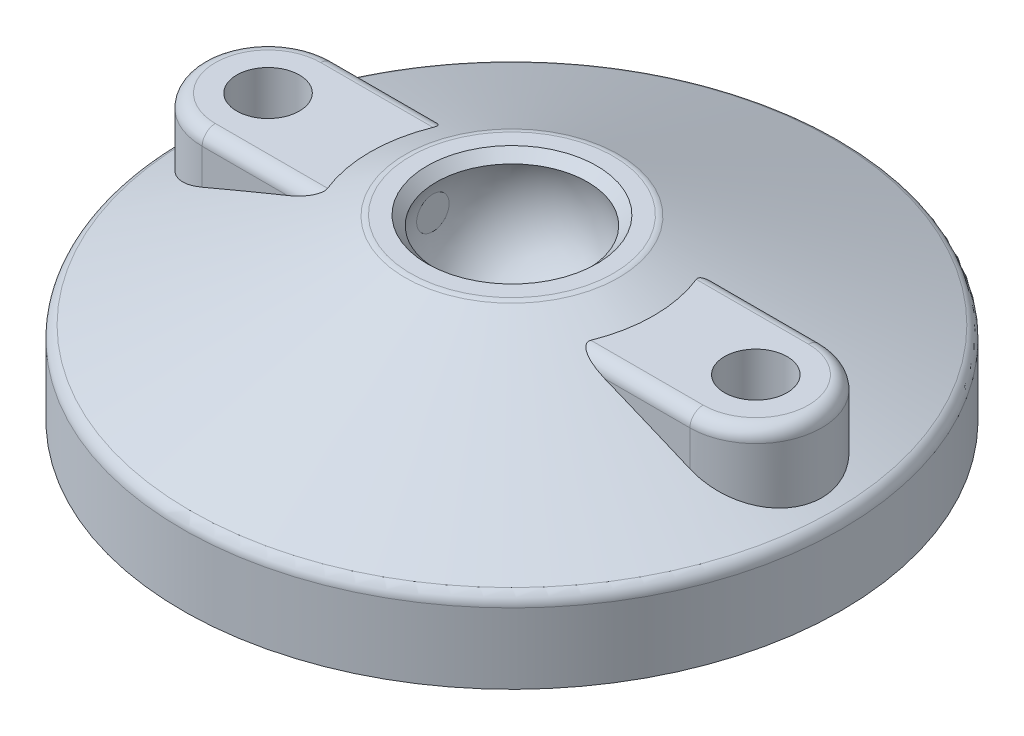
ISO-10303-21;
HEADER;
FILE_DESCRIPTION(('STEP AP214'),'2;1');
FILE_NAME('part.step','',(''),(''),'','','');
FILE_SCHEMA(('AUTOMOTIVE_DESIGN { 1 0 10303 214 1 1 1 1 }'));
ENDSEC;
DATA;
#1=APPLICATION_CONTEXT('core data for automotive mechanical design processes');
#2=APPLICATION_PROTOCOL_DEFINITION('international standard','automotive_design',2000,#1);
#3=PRODUCT_CONTEXT('',#1,'mechanical');
#4=PRODUCT('Part','Part','',(#3));
#5=PRODUCT_RELATED_PRODUCT_CATEGORY('part','',(#4));
#6=PRODUCT_DEFINITION_FORMATION('','',#4);
#7=PRODUCT_DEFINITION_CONTEXT('part definition',#1,'design');
#8=PRODUCT_DEFINITION('design','',#6,#7);
#9=PRODUCT_DEFINITION_SHAPE('','',#8);
#10=(LENGTH_UNIT() NAMED_UNIT(*) SI_UNIT(.MILLI.,.METRE.));
#11=(NAMED_UNIT(*) PLANE_ANGLE_UNIT() SI_UNIT($,.RADIAN.));
#12=(NAMED_UNIT(*) SI_UNIT($,.STERADIAN.) SOLID_ANGLE_UNIT());
#13=UNCERTAINTY_MEASURE_WITH_UNIT(LENGTH_MEASURE(1.E-05),#10,'distance_accuracy_value','');
#14=(GEOMETRIC_REPRESENTATION_CONTEXT(3) GLOBAL_UNCERTAINTY_ASSIGNED_CONTEXT((#13)) GLOBAL_UNIT_ASSIGNED_CONTEXT((#10,
#11,#12)) REPRESENTATION_CONTEXT('',''));
#15=CARTESIAN_POINT('',(0.,0.,0.));
#16=DIRECTION('',(0.,0.,1.));
#17=DIRECTION('',(1.,0.,0.));
#18=AXIS2_PLACEMENT_3D('',#15,#16,#17);
#19=CARTESIAN_POINT('',(-12.,4.99999999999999,-10.));
#20=DIRECTION('',(1.,0.,0.));
#21=DIRECTION('',(0.,0.,-1.));
#22=AXIS2_PLACEMENT_3D('',#19,#20,#21);
#23=PLANE('',#22);
#24=CARTESIAN_POINT('',(-12.,21.25,0.));
#25=DIRECTION('',(1.,0.,0.));
#26=DIRECTION('',(0.,0.,-1.));
#27=AXIS2_PLACEMENT_3D('',#24,#25,#26);
#28=CIRCLE('',#27,2.46221445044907);
#29=CARTESIAN_POINT('',(-12.,21.25,-2.46221445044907));
#30=VERTEX_POINT('',#29);
#31=EDGE_CURVE('E19',#30,#30,#28,.F.);
#32=ORIENTED_EDGE('',*,*,#31,.F.);
#33=EDGE_LOOP('',(#32));
#34=FACE_BOUND('',#33,.T.);
#35=ADVANCED_FACE('F15',(#34),#23,.T.);
#36=CARTESIAN_POINT('',(12.,5.,10.));
#37=DIRECTION('',(-1.,0.,0.));
#38=DIRECTION('',(0.,0.,1.));
#39=AXIS2_PLACEMENT_3D('',#36,#37,#38);
#40=PLANE('',#39);
#41=CARTESIAN_POINT('',(12.,21.25,0.));
#42=DIRECTION('',(-1.,0.,0.));
#43=DIRECTION('',(0.,0.,1.));
#44=AXIS2_PLACEMENT_3D('',#41,#42,#43);
#45=CIRCLE('',#44,2.46221445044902);
#46=CARTESIAN_POINT('',(12.,21.25,2.46221445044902));
#47=VERTEX_POINT('',#46);
#48=EDGE_CURVE('E220',#47,#47,#45,.F.);
#49=ORIENTED_EDGE('',*,*,#48,.F.);
#50=EDGE_LOOP('',(#49));
#51=FACE_BOUND('',#50,.T.);
#52=ADVANCED_FACE('F229',(#51),#40,.T.);
#53=CARTESIAN_POINT('',(0.,21.25,0.));
#54=DIRECTION('',(0.,0.,1.));
#55=DIRECTION('',(-1.,0.,0.));
#56=AXIS2_PLACEMENT_3D('',#53,#54,#55);
#57=SPHERICAL_SURFACE('',#56,12.25);
#58=CARTESIAN_POINT('',(0.,25.5857864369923,0.));
#59=DIRECTION('',(0.,1.,0.));
#60=DIRECTION('',(0.,0.,1.));
#61=AXIS2_PLACEMENT_3D('',#58,#59,#60);
#62=CIRCLE('',#61,11.4570264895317);
#63=CARTESIAN_POINT('',(0.,25.5857864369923,11.4570264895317));
#64=VERTEX_POINT('',#63);
#65=EDGE_CURVE('E218',#64,#64,#62,.T.);
#66=ORIENTED_EDGE('',*,*,#65,.T.);
#67=EDGE_LOOP('',(#66));
#68=FACE_BOUND('',#67,.T.);
#69=ORIENTED_EDGE('',*,*,#48,.T.);
#70=EDGE_LOOP('',(#69));
#71=FACE_BOUND('',#70,.T.);
#72=ORIENTED_EDGE('',*,*,#31,.T.);
#73=EDGE_LOOP('',(#72));
#74=FACE_BOUND('',#73,.T.);
#75=ADVANCED_FACE('F17',(#68,#71,#74),#57,.F.);
#76=CARTESIAN_POINT('',(0.,27.0000000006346,0.));
#77=DIRECTION('',(0.,1.,0.));
#78=DIRECTION('',(0.,0.,1.));
#79=AXIS2_PLACEMENT_3D('',#76,#77,#78);
#80=CONICAL_SURFACE('',#79,12.8712400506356,0.785398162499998);
#81=ORIENTED_EDGE('',*,*,#65,.F.);
#82=EDGE_LOOP('',(#81));
#83=FACE_BOUND('',#82,.T.);
#84=CARTESIAN_POINT('',(0.,27.0000000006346,0.));
#85=DIRECTION('',(0.,1.,0.));
#86=DIRECTION('',(0.,0.,1.));
#87=AXIS2_PLACEMENT_3D('',#84,#85,#86);
#88=CIRCLE('',#87,12.8712400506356);
#89=CARTESIAN_POINT('',(0.,27.0000000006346,12.8712400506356));
#90=VERTEX_POINT('',#89);
#91=EDGE_CURVE('E215',#90,#90,#88,.F.);
#92=ORIENTED_EDGE('',*,*,#91,.F.);
#93=EDGE_LOOP('',(#92));
#94=FACE_BOUND('',#93,.T.);
#95=ADVANCED_FACE('F460',(#83,#94),#80,.F.);
#96=CARTESIAN_POINT('',(14.1341947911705,27.,0.));
#97=DIRECTION('',(0.,1.,0.));
#98=DIRECTION('',(0.,0.,1.));
#99=AXIS2_PLACEMENT_3D('',#96,#97,#98);
#100=PLANE('',#99);
#101=ORIENTED_EDGE('',*,*,#91,.T.);
#102=EDGE_LOOP('',(#101));
#103=FACE_BOUND('',#102,.T.);
#104=CARTESIAN_POINT('',(0.,27.,0.));
#105=DIRECTION('',(0.,-1.,0.));
#106=DIRECTION('',(1.,0.,0.));
#107=AXIS2_PLACEMENT_3D('',#104,#105,#106);
#108=CIRCLE('',#107,15.3971495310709);
#109=CARTESIAN_POINT('',(15.3971495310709,27.,0.));
#110=VERTEX_POINT('',#109);
#111=EDGE_CURVE('E395',#110,#110,#108,.T.);
#112=ORIENTED_EDGE('',*,*,#111,.F.);
#113=EDGE_LOOP('',(#112));
#114=FACE_BOUND('',#113,.T.);
#115=ADVANCED_FACE('F455',(#103,#114),#100,.T.);
#116=CARTESIAN_POINT('',(0.,10.6935375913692,0.));
#117=DIRECTION('',(0.,-1.,0.));
#118=DIRECTION('',(0.,0.,-1.));
#119=AXIS2_PLACEMENT_3D('',#116,#117,#118);
#120=TOROIDAL_SURFACE('',#119,48.,2.);
#121=CARTESIAN_POINT('',(0.,12.5249700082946,0.));
#122=DIRECTION('',(0.,-1.,0.));
#123=DIRECTION('',(1.,0.,0.));
#124=AXIS2_PLACEMENT_3D('',#121,#122,#123);
#125=CIRCLE('',#124,48.8036511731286);
#126=CARTESIAN_POINT('',(48.8036511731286,12.5249700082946,0.));
#127=VERTEX_POINT('',#126);
#128=EDGE_CURVE('E214',#127,#127,#125,.F.);
#129=ORIENTED_EDGE('',*,*,#128,.F.);
#130=EDGE_LOOP('',(#129));
#131=FACE_BOUND('',#130,.T.);
#132=CARTESIAN_POINT('',(0.,10.6935375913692,0.));
#133=DIRECTION('',(0.,-1.,0.));
#134=DIRECTION('',(1.,0.,0.));
#135=AXIS2_PLACEMENT_3D('',#132,#133,#134);
#136=CIRCLE('',#135,50.);
#137=CARTESIAN_POINT('',(50.,10.6935375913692,0.));
#138=VERTEX_POINT('',#137);
#139=EDGE_CURVE('E392',#138,#138,#136,.T.);
#140=ORIENTED_EDGE('',*,*,#139,.F.);
#141=EDGE_LOOP('',(#140));
#142=FACE_BOUND('',#141,.T.);
#143=ADVANCED_FACE('F205',(#131,#142),#120,.T.);
#144=CARTESIAN_POINT('',(-12.,4.99999999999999,10.));
#145=DIRECTION('',(0.,0.,1.));
#146=DIRECTION('',(1.,0.,0.));
#147=AXIS2_PLACEMENT_3D('',#144,#145,#146);
#148=PLANE('',#147);
#149=DIRECTION('',(0.,1.,0.));
#150=VECTOR('',#149,1.);
#151=CARTESIAN_POINT('',(-37.,4.99999999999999,10.));
#152=LINE('',#151,#150);
#153=CARTESIAN_POINT('',(-36.9999998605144,17.1219960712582,10.));
#154=VERTEX_POINT('',#153);
#155=CARTESIAN_POINT('',(-37.,22.5,10.));
#156=VERTEX_POINT('',#155);
#157=EDGE_CURVE('E68',#154,#156,#152,.T.);
#158=ORIENTED_EDGE('',*,*,#157,.F.);
#159=CARTESIAN_POINT('',(-24.0776106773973,22.4999999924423,9.99999999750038));
#160=CARTESIAN_POINT('',(-24.6181248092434,22.2809472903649,9.99999999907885));
#161=CARTESIAN_POINT('',(-25.1582677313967,22.060981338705,9.99999999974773));
#162=CARTESIAN_POINT('',(-26.2379094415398,21.6194777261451,10.0000000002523));
#163=CARTESIAN_POINT('',(-26.7774082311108,21.3979400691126,10.0000000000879));
#164=CARTESIAN_POINT('',(-28.3950742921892,20.7313564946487,9.99999999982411));
#165=CARTESIAN_POINT('',(-29.472426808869,20.2843336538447,9.99999999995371));
#166=CARTESIAN_POINT('',(-31.6255067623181,19.386419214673,10.0000000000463));
#167=CARTESIAN_POINT('',(-32.7012342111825,18.9355276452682,10.0000000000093));
#168=CARTESIAN_POINT('',(-34.3139051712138,18.2569828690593,9.99999999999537));
#169=CARTESIAN_POINT('',(-34.8513127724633,18.0304316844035,9.99999999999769));
#170=CARTESIAN_POINT('',(-35.9258533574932,17.5766798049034,10.0000000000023));
#171=CARTESIAN_POINT('',(-36.4629863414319,17.3494791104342,10.0000000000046));
#172=CARTESIAN_POINT('',(-36.9999997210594,17.1219961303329,10.));
#173=B_SPLINE_CURVE_WITH_KNOTS('',3,(#159,#160,#161,#162,#163,#164,#165,#166,#167,#168,#169,
#170,#171,#172),.UNSPECIFIED.,.F.,.F.,(4,2,2,2,2,2,4),(0.,1.74964231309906,3.4992803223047,
6.99850597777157,10.4977054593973,12.2473311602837,13.9969558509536),.UNSPECIFIED.);
#174=CARTESIAN_POINT('',(-24.077610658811,22.4999999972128,10.));
#175=VERTEX_POINT('',#174);
#176=EDGE_CURVE('E209',#175,#154,#173,.T.);
#177=ORIENTED_EDGE('',*,*,#176,.F.);
#178=DIRECTION('',(-1.,0.,0.));
#179=VECTOR('',#178,1.);
#180=CARTESIAN_POINT('',(-19.8425477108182,22.5,10.));
#181=LINE('',#180,#179);
#182=EDGE_CURVE('E58',#156,#175,#181,.F.);
#183=ORIENTED_EDGE('',*,*,#182,.F.);
#184=EDGE_LOOP('',(#158,#177,#183));
#185=FACE_BOUND('',#184,.T.);
#186=ADVANCED_FACE('F201',(#185),#148,.T.);
#187=CARTESIAN_POINT('',(-37.,4.99999999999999,0.));
#188=DIRECTION('',(0.,1.,0.));
#189=DIRECTION('',(-1.,0.,0.));
#190=AXIS2_PLACEMENT_3D('',#187,#188,#189);
#191=CYLINDRICAL_SURFACE('',#190,10.);
#192=CARTESIAN_POINT('',(-36.9999997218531,17.1219961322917,10.0000000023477));
#193=CARTESIAN_POINT('',(-37.2929987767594,16.9978689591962,10.0000220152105));
#194=CARTESIAN_POINT('',(-37.5865196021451,16.8749136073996,9.98712293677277));
#195=CARTESIAN_POINT('',(-38.1725784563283,16.6319807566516,9.93536621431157));
#196=CARTESIAN_POINT('',(-38.4651162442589,16.5120039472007,9.89650261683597));
#197=CARTESIAN_POINT('',(-39.0476557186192,16.2754725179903,9.7925916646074));
#198=CARTESIAN_POINT('',(-39.3376508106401,16.1589255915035,9.72748964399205));
#199=CARTESIAN_POINT('',(-39.9122499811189,15.9301738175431,9.57117719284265));
#200=CARTESIAN_POINT('',(-40.1968544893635,15.8179686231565,9.47996885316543));
#201=CARTESIAN_POINT('',(-40.7589783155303,15.5983106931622,9.27146816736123));
#202=CARTESIAN_POINT('',(-41.0364824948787,15.4908678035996,9.15412455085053));
#203=CARTESIAN_POINT('',(-41.5814600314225,15.2816060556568,8.89389657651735));
#204=CARTESIAN_POINT('',(-41.8489336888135,15.179787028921,8.75101298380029));
#205=CARTESIAN_POINT('',(-42.3711949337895,14.9824926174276,8.44052479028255));
#206=CARTESIAN_POINT('',(-42.6259952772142,14.8870108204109,8.27294574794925));
#207=CARTESIAN_POINT('',(-43.1207874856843,14.7028870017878,7.91387280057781));
#208=CARTESIAN_POINT('',(-43.3607802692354,14.6142445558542,7.7223803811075));
#209=CARTESIAN_POINT('',(-43.811954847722,14.4486493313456,7.32684840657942));
#210=CARTESIAN_POINT('',(-44.023978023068,14.3713331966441,7.12392034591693));
#211=CARTESIAN_POINT('',(-44.4304988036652,14.2238874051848,6.69881815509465));
#212=CARTESIAN_POINT('',(-44.624997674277,14.153757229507,6.47664541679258));
#213=CARTESIAN_POINT('',(-44.9945532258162,14.0211376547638,6.01453666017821));
#214=CARTESIAN_POINT('',(-45.1696094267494,13.9586484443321,5.77460020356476));
#215=CARTESIAN_POINT('',(-45.4984500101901,13.8417425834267,5.27871579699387));
#216=CARTESIAN_POINT('',(-45.6522355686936,13.7873254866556,5.02276873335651));
#217=CARTESIAN_POINT('',(-45.927765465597,13.69016267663,4.51368385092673));
#218=CARTESIAN_POINT('',(-46.0509301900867,13.6468930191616,4.26141376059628));
#219=CARTESIAN_POINT('',(-46.2759600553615,13.5680445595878,3.74640079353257));
#220=CARTESIAN_POINT('',(-46.3778269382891,13.5324651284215,3.48365877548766));
#221=CARTESIAN_POINT('',(-46.55921212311,13.4692409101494,2.94973469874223));
#222=CARTESIAN_POINT('',(-46.638737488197,13.4415936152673,2.67855533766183));
#223=CARTESIAN_POINT('',(-46.774660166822,13.394407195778,2.12976988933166));
#224=CARTESIAN_POINT('',(-46.8310581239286,13.3748678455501,1.85216398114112));
#225=CARTESIAN_POINT('',(-46.9180804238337,13.3447435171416,1.30563532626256));
#226=CARTESIAN_POINT('',(-46.9497735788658,13.333787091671,1.03690267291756));
#227=CARTESIAN_POINT('',(-46.9912753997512,13.3194433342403,0.497556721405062));
#228=CARTESIAN_POINT('',(-47.0010848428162,13.3160557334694,0.226943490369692));
#229=CARTESIAN_POINT('',(-46.9987250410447,13.3168709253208,-0.314147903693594));
#230=CARTESIAN_POINT('',(-46.9865579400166,13.3210729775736,-0.584626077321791));
#231=CARTESIAN_POINT('',(-46.9403675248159,13.337039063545,-1.12348443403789));
#232=CARTESIAN_POINT('',(-46.9063442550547,13.3488030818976,-1.39186462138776));
#233=CARTESIAN_POINT('',(-46.8175275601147,13.3795559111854,-1.92006853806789));
#234=CARTESIAN_POINT('',(-46.7630942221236,13.398419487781,-2.17996023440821));
#235=CARTESIAN_POINT('',(-46.6339255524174,13.4432673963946,-2.69401390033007));
#236=CARTESIAN_POINT('',(-46.5591905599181,13.4692516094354,-2.94817596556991));
#237=CARTESIAN_POINT('',(-46.3900967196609,13.5281853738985,-3.4490509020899));
#238=CARTESIAN_POINT('',(-46.2957378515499,13.5611349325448,-3.69576376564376));
#239=CARTESIAN_POINT('',(-46.088233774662,13.6338067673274,-4.18012267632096));
#240=CARTESIAN_POINT('',(-45.9750882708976,13.6735291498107,-4.41776858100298));
#241=CARTESIAN_POINT('',(-45.7292123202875,13.7601464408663,-4.88587345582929));
#242=CARTESIAN_POINT('',(-45.5962208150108,13.8071373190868,-5.11617750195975));
#243=CARTESIAN_POINT('',(-45.3130567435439,13.9075900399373,-5.5644747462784));
#244=CARTESIAN_POINT('',(-45.1628840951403,13.9610519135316,-5.78246788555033));
#245=CARTESIAN_POINT('',(-44.8466032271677,14.0741552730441,-6.20487192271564));
#246=CARTESIAN_POINT('',(-44.6804944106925,14.1337969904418,-6.40928231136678));
#247=CARTESIAN_POINT('',(-44.3336704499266,14.2589456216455,-6.80339544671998));
#248=CARTESIAN_POINT('',(-44.15295439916,14.3244528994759,-6.99309727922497));
#249=CARTESIAN_POINT('',(-43.7706027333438,14.4638073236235,-7.36429356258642));
#250=CARTESIAN_POINT('',(-43.568412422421,14.5378866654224,-7.54512957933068));
#251=CARTESIAN_POINT('',(-43.1513240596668,14.6916479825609,-7.88886873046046));
#252=CARTESIAN_POINT('',(-42.9364256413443,14.771330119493,-8.05177134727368));
#253=CARTESIAN_POINT('',(-42.4955112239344,14.9359090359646,-8.35892088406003));
#254=CARTESIAN_POINT('',(-42.2694928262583,15.0208069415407,-8.50316375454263));
#255=CARTESIAN_POINT('',(-41.8079279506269,15.1954220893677,-8.77241410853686));
#256=CARTESIAN_POINT('',(-41.5723774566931,15.2851413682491,-8.89741337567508));
#257=CARTESIAN_POINT('',(-41.0793108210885,15.4743765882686,-9.13446216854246));
#258=CARTESIAN_POINT('',(-40.8213189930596,15.5741581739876,-9.24531094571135));
#259=CARTESIAN_POINT('',(-40.2985726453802,15.7780694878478,-9.44444943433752));
#260=CARTESIAN_POINT('',(-40.0338205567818,15.8821976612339,-9.53274713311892));
#261=CARTESIAN_POINT('',(-39.4994762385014,16.0942569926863,-9.68658237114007));
#262=CARTESIAN_POINT('',(-39.2298868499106,16.2021859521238,-9.75213283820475));
#263=CARTESIAN_POINT('',(-38.6876063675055,16.4213445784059,-9.86044595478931));
#264=CARTESIAN_POINT('',(-38.4149165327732,16.5325729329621,-9.90321753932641));
#265=CARTESIAN_POINT('',(-37.9514129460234,16.7235052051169,-9.9564777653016));
#266=CARTESIAN_POINT('',(-37.7609560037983,16.8024933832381,-9.97283108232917));
#267=CARTESIAN_POINT('',(-37.3802671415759,16.961488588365,-9.99458261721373));
#268=CARTESIAN_POINT('',(-37.1900354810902,17.0414933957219,-10.0000015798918));
#269=CARTESIAN_POINT('',(-36.9999999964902,17.1219960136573,-10.));
#270=B_SPLINE_CURVE_WITH_KNOTS('',3,(#192,#193,#194,#195,#196,#197,#198,#199,#200,#201,#202,
#203,#204,#205,#206,#207,#208,#209,#210,#211,#212,#213,#214,#215,#216,#217,#218,#219,#220,#221,
#222,#223,#224,#225,#226,#227,#228,#229,#230,#231,#232,#233,#234,#235,#236,#237,#238,#239,#240,
#241,#242,#243,#244,#245,#246,#247,#248,#249,#250,#251,#252,#253,#254,#255,#256,#257,#258,#259,
#260,#261,#262,#263,#264,#265,#266,#267,#268,#269),.UNSPECIFIED.,.F.,.F.,(4,2,2,2,2,2,2,2,2,2,2,
2,2,2,2,2,2,2,2,2,2,2,2,2,2,2,2,2,2,2,2,2,2,2,2,2,2,2,4),(0.,0.954393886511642,1.90900668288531,
2.86561871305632,3.82215414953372,4.78058284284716,5.73898282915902,6.69639779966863,
7.65375332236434,8.56307793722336,9.47233684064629,10.3816181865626,11.2908492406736,
12.1419149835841,12.9929110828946,13.8436378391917,14.6943409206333,15.5058056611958,
16.3172415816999,17.1285983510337,17.9399534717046,18.7376205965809,19.5352743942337,
20.3329290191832,21.130596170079,21.9398718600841,22.7491514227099,23.5584613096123,
24.3678214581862,25.2104689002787,26.0531406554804,26.8959949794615,27.7392081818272,
28.6322193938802,29.524913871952,30.4171001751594,31.3089362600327,31.9291636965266,
32.5482133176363),.UNSPECIFIED.);
#271=CARTESIAN_POINT('',(-36.9999999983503,17.1219960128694,-10.));
#272=VERTEX_POINT('',#271);
#273=EDGE_CURVE('E154',#154,#272,#270,.T.);
#274=ORIENTED_EDGE('',*,*,#273,.F.);
#275=ORIENTED_EDGE('',*,*,#157,.T.);
#276=CARTESIAN_POINT('',(-37.,22.5,0.));
#277=DIRECTION('',(0.,-1.,0.));
#278=DIRECTION('',(0.,0.,-1.));
#279=AXIS2_PLACEMENT_3D('',#276,#277,#278);
#280=CIRCLE('',#279,10.);
#281=CARTESIAN_POINT('',(-37.,22.5,-10.));
#282=VERTEX_POINT('',#281);
#283=EDGE_CURVE('E328',#282,#156,#280,.F.);
#284=ORIENTED_EDGE('',*,*,#283,.F.);
#285=DIRECTION('',(0.,1.,0.));
#286=VECTOR('',#285,1.);
#287=CARTESIAN_POINT('',(-37.,4.99999999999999,-10.));
#288=LINE('',#287,#286);
#289=EDGE_CURVE('E116',#272,#282,#288,.T.);
#290=ORIENTED_EDGE('',*,*,#289,.F.);
#291=EDGE_LOOP('',(#274,#275,#284,#290));
#292=FACE_BOUND('',#291,.T.);
#293=ADVANCED_FACE('F195',(#292),#191,.T.);
#294=CARTESIAN_POINT('',(-37.,4.99999999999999,-10.));
#295=DIRECTION('',(0.,0.,-1.));
#296=DIRECTION('',(-1.,0.,0.));
#297=AXIS2_PLACEMENT_3D('',#294,#295,#296);
#298=PLANE('',#297);
#299=CARTESIAN_POINT('',(-36.9999999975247,17.1219960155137,-10.0000000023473));
#300=CARTESIAN_POINT('',(-36.4629866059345,17.3494789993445,-10.000000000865));
#301=CARTESIAN_POINT('',(-35.9258536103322,17.5766796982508,-10.0000000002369));
#302=CARTESIAN_POINT('',(-34.8513130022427,18.0304315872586,-9.9999999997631));
#303=CARTESIAN_POINT('',(-34.3139053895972,18.256982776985,-9.99999999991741));
#304=CARTESIAN_POINT('',(-32.7012343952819,18.9355275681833,-10.0000000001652));
#305=CARTESIAN_POINT('',(-31.6255069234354,19.3864191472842,-10.0000000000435));
#306=CARTESIAN_POINT('',(-29.4724269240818,20.2843336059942,-9.99999999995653));
#307=CARTESIAN_POINT('',(-28.3950743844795,20.7313564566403,-9.99999999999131));
#308=CARTESIAN_POINT('',(-26.7774082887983,21.3979400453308,-10.0000000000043));
#309=CARTESIAN_POINT('',(-26.2379094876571,21.6194777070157,-10.0000000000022));
#310=CARTESIAN_POINT('',(-25.1582677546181,22.060981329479,-9.99999999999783));
#311=CARTESIAN_POINT('',(-24.6181248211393,22.2809472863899,-9.99999999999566));
#312=CARTESIAN_POINT('',(-24.077610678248,22.4999999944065,-10.));
#313=B_SPLINE_CURVE_WITH_KNOTS('',3,(#299,#300,#301,#302,#303,#304,#305,#306,#307,#308,#309,
#310,#311,#312),.UNSPECIFIED.,.F.,.F.,(4,2,2,2,2,2,4),(0.,1.74962472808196,3.4992504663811,
6.99845002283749,10.497675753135,12.2473137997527,13.9969561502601),.UNSPECIFIED.);
#314=CARTESIAN_POINT('',(-24.0776106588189,22.4999999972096,-10.));
#315=VERTEX_POINT('',#314);
#316=EDGE_CURVE('E187',#272,#315,#313,.T.);
#317=ORIENTED_EDGE('',*,*,#316,.F.);
#318=ORIENTED_EDGE('',*,*,#289,.T.);
#319=DIRECTION('',(1.,0.,0.));
#320=VECTOR('',#319,1.);
#321=CARTESIAN_POINT('',(-32.3425477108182,22.5,-10.));
#322=LINE('',#321,#320);
#323=EDGE_CURVE('E352',#315,#282,#322,.F.);
#324=ORIENTED_EDGE('',*,*,#323,.F.);
#325=EDGE_LOOP('',(#317,#318,#324));
#326=FACE_BOUND('',#325,.T.);
#327=ADVANCED_FACE('F192',(#326),#298,.T.);
#328=CARTESIAN_POINT('',(12.,5.,-10.));
#329=DIRECTION('',(0.,0.,-1.));
#330=DIRECTION('',(-1.,0.,0.));
#331=AXIS2_PLACEMENT_3D('',#328,#329,#330);
#332=PLANE('',#331);
#333=DIRECTION('',(0.,1.,0.));
#334=VECTOR('',#333,1.);
#335=CARTESIAN_POINT('',(37.,5.,-10.));
#336=LINE('',#335,#334);
#337=CARTESIAN_POINT('',(36.9999998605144,17.1219960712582,-10.));
#338=VERTEX_POINT('',#337);
#339=CARTESIAN_POINT('',(37.,22.5,-10.));
#340=VERTEX_POINT('',#339);
#341=EDGE_CURVE('E110',#338,#340,#336,.T.);
#342=ORIENTED_EDGE('',*,*,#341,.F.);
#343=CARTESIAN_POINT('',(24.0776106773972,22.4999999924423,-9.99999999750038));
#344=CARTESIAN_POINT('',(24.6181248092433,22.280947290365,-9.99999999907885));
#345=CARTESIAN_POINT('',(25.1582677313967,22.060981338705,-9.99999999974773));
#346=CARTESIAN_POINT('',(26.2379094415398,21.6194777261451,-10.0000000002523));
#347=CARTESIAN_POINT('',(26.7774082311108,21.3979400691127,-10.0000000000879));
#348=CARTESIAN_POINT('',(28.3950742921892,20.7313564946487,-9.99999999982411));
#349=CARTESIAN_POINT('',(29.472426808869,20.2843336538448,-9.99999999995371));
#350=CARTESIAN_POINT('',(31.6255067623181,19.386419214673,-10.0000000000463));
#351=CARTESIAN_POINT('',(32.7012342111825,18.9355276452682,-10.0000000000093));
#352=CARTESIAN_POINT('',(34.3139051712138,18.2569828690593,-9.99999999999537));
#353=CARTESIAN_POINT('',(34.8513127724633,18.0304316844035,-9.99999999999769));
#354=CARTESIAN_POINT('',(35.9258533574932,17.5766798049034,-10.0000000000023));
#355=CARTESIAN_POINT('',(36.4629863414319,17.3494791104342,-10.0000000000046));
#356=CARTESIAN_POINT('',(36.9999997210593,17.121996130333,-10.));
#357=B_SPLINE_CURVE_WITH_KNOTS('',3,(#343,#344,#345,#346,#347,#348,#349,#350,#351,#352,#353,
#354,#355,#356),.UNSPECIFIED.,.F.,.F.,(4,2,2,2,2,2,4),(0.,1.74964231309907,3.49928032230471,
6.99850597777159,10.4977054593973,12.2473311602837,13.9969558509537),.UNSPECIFIED.);
#358=CARTESIAN_POINT('',(24.0776106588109,22.4999999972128,-10.));
#359=VERTEX_POINT('',#358);
#360=EDGE_CURVE('E97',#359,#338,#357,.T.);
#361=ORIENTED_EDGE('',*,*,#360,.F.);
#362=DIRECTION('',(1.,0.,0.));
#363=VECTOR('',#362,1.);
#364=CARTESIAN_POINT('',(19.8425477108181,22.5,-10.));
#365=LINE('',#364,#363);
#366=EDGE_CURVE('E92',#340,#359,#365,.F.);
#367=ORIENTED_EDGE('',*,*,#366,.F.);
#368=EDGE_LOOP('',(#342,#361,#367));
#369=FACE_BOUND('',#368,.T.);
#370=ADVANCED_FACE('F111',(#369),#332,.T.);
#371=CARTESIAN_POINT('',(37.,5.,0.));
#372=DIRECTION('',(0.,1.,0.));
#373=DIRECTION('',(-1.,0.,0.));
#374=AXIS2_PLACEMENT_3D('',#371,#372,#373);
#375=CYLINDRICAL_SURFACE('',#374,10.);
#376=CARTESIAN_POINT('',(36.9999997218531,17.1219961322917,-10.0000000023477));
#377=CARTESIAN_POINT('',(37.2929987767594,16.9978689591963,-10.0000220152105));
#378=CARTESIAN_POINT('',(37.5865196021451,16.8749136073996,-9.98712293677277));
#379=CARTESIAN_POINT('',(38.1725784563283,16.6319807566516,-9.93536621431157));
#380=CARTESIAN_POINT('',(38.4651162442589,16.5120039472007,-9.89650261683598));
#381=CARTESIAN_POINT('',(39.0476557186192,16.2754725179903,-9.79259166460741));
#382=CARTESIAN_POINT('',(39.3376508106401,16.1589255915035,-9.72748964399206));
#383=CARTESIAN_POINT('',(39.9122499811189,15.9301738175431,-9.57117719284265));
#384=CARTESIAN_POINT('',(40.1968544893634,15.8179686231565,-9.47996885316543));
#385=CARTESIAN_POINT('',(40.7589783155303,15.5983106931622,-9.27146816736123));
#386=CARTESIAN_POINT('',(41.0364824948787,15.4908678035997,-9.15412455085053));
#387=CARTESIAN_POINT('',(41.5814600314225,15.2816060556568,-8.89389657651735));
#388=CARTESIAN_POINT('',(41.8489336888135,15.179787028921,-8.75101298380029));
#389=CARTESIAN_POINT('',(42.3711949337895,14.9824926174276,-8.44052479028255));
#390=CARTESIAN_POINT('',(42.6259952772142,14.8870108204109,-8.27294574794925));
#391=CARTESIAN_POINT('',(43.1207874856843,14.7028870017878,-7.91387280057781));
#392=CARTESIAN_POINT('',(43.3607802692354,14.6142445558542,-7.7223803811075));
#393=CARTESIAN_POINT('',(43.811954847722,14.4486493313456,-7.32684840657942));
#394=CARTESIAN_POINT('',(44.023978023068,14.3713331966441,-7.12392034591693));
#395=CARTESIAN_POINT('',(44.4304988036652,14.2238874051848,-6.69881815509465));
#396=CARTESIAN_POINT('',(44.624997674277,14.153757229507,-6.47664541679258));
#397=CARTESIAN_POINT('',(44.9945532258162,14.0211376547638,-6.01453666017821));
#398=CARTESIAN_POINT('',(45.1696094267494,13.9586484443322,-5.77460020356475));
#399=CARTESIAN_POINT('',(45.4984500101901,13.8417425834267,-5.27871579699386));
#400=CARTESIAN_POINT('',(45.6522355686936,13.7873254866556,-5.0227687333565));
#401=CARTESIAN_POINT('',(45.927765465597,13.6901626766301,-4.51368385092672));
#402=CARTESIAN_POINT('',(46.0509301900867,13.6468930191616,-4.26141376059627));
#403=CARTESIAN_POINT('',(46.2759600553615,13.5680445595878,-3.74640079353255));
#404=CARTESIAN_POINT('',(46.3778269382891,13.5324651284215,-3.48365877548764));
#405=CARTESIAN_POINT('',(46.55921212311,13.4692409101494,-2.94973469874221));
#406=CARTESIAN_POINT('',(46.638737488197,13.4415936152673,-2.67855533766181));
#407=CARTESIAN_POINT('',(46.774660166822,13.394407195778,-2.12976988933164));
#408=CARTESIAN_POINT('',(46.8310581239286,13.3748678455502,-1.85216398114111));
#409=CARTESIAN_POINT('',(46.9180804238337,13.3447435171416,-1.30563532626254));
#410=CARTESIAN_POINT('',(46.9497735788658,13.333787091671,-1.03690267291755));
#411=CARTESIAN_POINT('',(46.9912753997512,13.3194433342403,-0.497556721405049));
#412=CARTESIAN_POINT('',(47.0010848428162,13.3160557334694,-0.22694349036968));
#413=CARTESIAN_POINT('',(46.9987250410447,13.3168709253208,0.314147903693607));
#414=CARTESIAN_POINT('',(46.9865579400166,13.3210729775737,0.584626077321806));
#415=CARTESIAN_POINT('',(46.9403675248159,13.337039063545,1.12348443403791));
#416=CARTESIAN_POINT('',(46.9063442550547,13.3488030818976,1.39186462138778));
#417=CARTESIAN_POINT('',(46.8175275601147,13.3795559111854,1.9200685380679));
#418=CARTESIAN_POINT('',(46.7630942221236,13.3984194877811,2.17996023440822));
#419=CARTESIAN_POINT('',(46.6339255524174,13.4432673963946,2.69401390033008));
#420=CARTESIAN_POINT('',(46.5591905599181,13.4692516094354,2.94817596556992));
#421=CARTESIAN_POINT('',(46.3900967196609,13.5281853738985,3.44905090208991));
#422=CARTESIAN_POINT('',(46.2957378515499,13.5611349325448,3.69576376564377));
#423=CARTESIAN_POINT('',(46.088233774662,13.6338067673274,4.18012267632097));
#424=CARTESIAN_POINT('',(45.9750882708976,13.6735291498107,4.41776858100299));
#425=CARTESIAN_POINT('',(45.7292123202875,13.7601464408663,4.8858734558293));
#426=CARTESIAN_POINT('',(45.5962208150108,13.8071373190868,5.11617750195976));
#427=CARTESIAN_POINT('',(45.3130567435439,13.9075900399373,5.56447474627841));
#428=CARTESIAN_POINT('',(45.1628840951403,13.9610519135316,5.78246788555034));
#429=CARTESIAN_POINT('',(44.8466032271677,14.0741552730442,6.20487192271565));
#430=CARTESIAN_POINT('',(44.6804944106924,14.1337969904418,6.4092823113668));
#431=CARTESIAN_POINT('',(44.3336704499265,14.2589456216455,6.80339544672));
#432=CARTESIAN_POINT('',(44.1529543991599,14.3244528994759,6.99309727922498));
#433=CARTESIAN_POINT('',(43.7706027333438,14.4638073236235,7.36429356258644));
#434=CARTESIAN_POINT('',(43.568412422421,14.5378866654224,7.54512957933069));
#435=CARTESIAN_POINT('',(43.1513240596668,14.6916479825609,7.88886873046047));
#436=CARTESIAN_POINT('',(42.9364256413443,14.771330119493,8.05177134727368));
#437=CARTESIAN_POINT('',(42.4955112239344,14.9359090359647,8.35892088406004));
#438=CARTESIAN_POINT('',(42.2694928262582,15.0208069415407,8.50316375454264));
#439=CARTESIAN_POINT('',(41.8079279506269,15.1954220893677,8.77241410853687));
#440=CARTESIAN_POINT('',(41.5723774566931,15.2851413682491,8.89741337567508));
#441=CARTESIAN_POINT('',(41.0793108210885,15.4743765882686,9.13446216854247));
#442=CARTESIAN_POINT('',(40.8213189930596,15.5741581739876,9.24531094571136));
#443=CARTESIAN_POINT('',(40.2985726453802,15.7780694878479,9.44444943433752));
#444=CARTESIAN_POINT('',(40.0338205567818,15.8821976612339,9.53274713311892));
#445=CARTESIAN_POINT('',(39.4994762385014,16.0942569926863,9.68658237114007));
#446=CARTESIAN_POINT('',(39.2298868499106,16.2021859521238,9.75213283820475));
#447=CARTESIAN_POINT('',(38.6876063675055,16.4213445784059,9.86044595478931));
#448=CARTESIAN_POINT('',(38.4149165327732,16.5325729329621,9.90321753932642));
#449=CARTESIAN_POINT('',(37.9514129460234,16.723505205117,9.9564777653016));
#450=CARTESIAN_POINT('',(37.7609560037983,16.8024933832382,9.97283108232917));
#451=CARTESIAN_POINT('',(37.3802671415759,16.961488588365,9.99458261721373));
#452=CARTESIAN_POINT('',(37.1900354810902,17.0414933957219,10.0000015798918));
#453=CARTESIAN_POINT('',(36.9999999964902,17.1219960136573,10.));
#454=B_SPLINE_CURVE_WITH_KNOTS('',3,(#376,#377,#378,#379,#380,#381,#382,#383,#384,#385,#386,
#387,#388,#389,#390,#391,#392,#393,#394,#395,#396,#397,#398,#399,#400,#401,#402,#403,#404,#405,
#406,#407,#408,#409,#410,#411,#412,#413,#414,#415,#416,#417,#418,#419,#420,#421,#422,#423,#424,
#425,#426,#427,#428,#429,#430,#431,#432,#433,#434,#435,#436,#437,#438,#439,#440,#441,#442,#443,
#444,#445,#446,#447,#448,#449,#450,#451,#452,#453),.UNSPECIFIED.,.F.,.F.,(4,2,2,2,2,2,2,2,2,2,2,
2,2,2,2,2,2,2,2,2,2,2,2,2,2,2,2,2,2,2,2,2,2,2,2,2,2,2,4),(0.,0.95439388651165,1.90900668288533,
2.86561871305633,3.82215414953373,4.78058284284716,5.73898282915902,6.69639779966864,
7.65375332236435,8.56307793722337,9.4723368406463,10.3816181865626,11.2908492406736,
12.1419149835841,12.9929110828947,13.8436378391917,14.6943409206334,15.5058056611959,
16.3172415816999,17.1285983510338,17.9399534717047,18.7376205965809,19.5352743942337,
20.3329290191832,21.130596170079,21.9398718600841,22.7491514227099,23.5584613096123,
24.3678214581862,25.2104689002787,26.0531406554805,26.8959949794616,27.7392081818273,
28.6322193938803,29.5249138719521,30.4171001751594,31.3089362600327,31.9291636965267,
32.5482133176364),.UNSPECIFIED.);
#455=CARTESIAN_POINT('',(36.9999999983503,17.1219960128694,10.));
#456=VERTEX_POINT('',#455);
#457=EDGE_CURVE('E103',#338,#456,#454,.T.);
#458=ORIENTED_EDGE('',*,*,#457,.F.);
#459=ORIENTED_EDGE('',*,*,#341,.T.);
#460=CARTESIAN_POINT('',(37.,22.5,0.));
#461=DIRECTION('',(0.,-1.,0.));
#462=DIRECTION('',(0.,0.,-1.));
#463=AXIS2_PLACEMENT_3D('',#460,#461,#462);
#464=CIRCLE('',#463,10.);
#465=CARTESIAN_POINT('',(37.,22.5,10.));
#466=VERTEX_POINT('',#465);
#467=EDGE_CURVE('E360',#466,#340,#464,.F.);
#468=ORIENTED_EDGE('',*,*,#467,.F.);
#469=DIRECTION('',(0.,1.,0.));
#470=VECTOR('',#469,1.);
#471=CARTESIAN_POINT('',(37.,5.,10.));
#472=LINE('',#471,#470);
#473=EDGE_CURVE('E115',#456,#466,#472,.T.);
#474=ORIENTED_EDGE('',*,*,#473,.F.);
#475=EDGE_LOOP('',(#458,#459,#468,#474));
#476=FACE_BOUND('',#475,.T.);
#477=ADVANCED_FACE('F118',(#476),#375,.T.);
#478=CARTESIAN_POINT('',(37.,5.,10.));
#479=DIRECTION('',(0.,0.,1.));
#480=DIRECTION('',(1.,0.,0.));
#481=AXIS2_PLACEMENT_3D('',#478,#479,#480);
#482=PLANE('',#481);
#483=CARTESIAN_POINT('',(36.9999999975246,17.1219960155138,10.0000000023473));
#484=CARTESIAN_POINT('',(36.4629866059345,17.3494789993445,10.000000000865));
#485=CARTESIAN_POINT('',(35.9258536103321,17.5766796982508,10.0000000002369));
#486=CARTESIAN_POINT('',(34.8513130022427,18.0304315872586,9.99999999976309));
#487=CARTESIAN_POINT('',(34.3139053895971,18.256982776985,9.99999999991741));
#488=CARTESIAN_POINT('',(32.7012343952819,18.9355275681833,10.0000000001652));
#489=CARTESIAN_POINT('',(31.6255069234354,19.3864191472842,10.0000000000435));
#490=CARTESIAN_POINT('',(29.4724269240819,20.2843336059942,9.99999999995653));
#491=CARTESIAN_POINT('',(28.3950743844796,20.7313564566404,9.99999999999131));
#492=CARTESIAN_POINT('',(26.7774082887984,21.3979400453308,10.0000000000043));
#493=CARTESIAN_POINT('',(26.2379094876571,21.6194777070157,10.0000000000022));
#494=CARTESIAN_POINT('',(25.1582677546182,22.060981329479,9.99999999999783));
#495=CARTESIAN_POINT('',(24.6181248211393,22.2809472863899,9.99999999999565));
#496=CARTESIAN_POINT('',(24.077610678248,22.4999999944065,10.));
#497=B_SPLINE_CURVE_WITH_KNOTS('',3,(#483,#484,#485,#486,#487,#488,#489,#490,#491,#492,#493,
#494,#495,#496),.UNSPECIFIED.,.F.,.F.,(4,2,2,2,2,2,4),(0.,1.74962472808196,3.49925046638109,
6.99845002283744,10.497675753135,12.2473137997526,13.99695615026),.UNSPECIFIED.);
#498=CARTESIAN_POINT('',(24.0776106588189,22.4999999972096,10.));
#499=VERTEX_POINT('',#498);
#500=EDGE_CURVE('E121',#456,#499,#497,.T.);
#501=ORIENTED_EDGE('',*,*,#500,.F.);
#502=ORIENTED_EDGE('',*,*,#473,.T.);
#503=DIRECTION('',(-1.,0.,0.));
#504=VECTOR('',#503,1.);
#505=CARTESIAN_POINT('',(32.3425477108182,22.5,10.));
#506=LINE('',#505,#504);
#507=EDGE_CURVE('E387',#499,#466,#506,.F.);
#508=ORIENTED_EDGE('',*,*,#507,.F.);
#509=EDGE_LOOP('',(#501,#502,#508));
#510=FACE_BOUND('',#509,.T.);
#511=ADVANCED_FACE('F405',(#510),#482,.T.);
#512=CARTESIAN_POINT('',(0.,25.,0.));
#513=DIRECTION('',(0.,-1.,0.));
#514=DIRECTION('',(0.,0.,-1.));
#515=AXIS2_PLACEMENT_3D('',#512,#513,#514);
#516=TOROIDAL_SURFACE('',#515,15.3971495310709,2.);
#517=ORIENTED_EDGE('',*,*,#111,.T.);
#518=EDGE_LOOP('',(#517));
#519=FACE_BOUND('',#518,.T.);
#520=CARTESIAN_POINT('',(0.,26.8314324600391,0.));
#521=DIRECTION('',(0.,-1.,0.));
#522=DIRECTION('',(1.,0.,0.));
#523=AXIS2_PLACEMENT_3D('',#520,#521,#522);
#524=CIRCLE('',#523,16.2008007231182);
#525=CARTESIAN_POINT('',(16.2008007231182,26.8314324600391,0.));
#526=VERTEX_POINT('',#525);
#527=EDGE_CURVE('E316',#526,#526,#524,.T.);
#528=ORIENTED_EDGE('',*,*,#527,.F.);
#529=EDGE_LOOP('',(#528));
#530=FACE_BOUND('',#529,.T.);
#531=ADVANCED_FACE('F401',(#519,#530),#516,.T.);
#532=CARTESIAN_POINT('',(0.,5.34676879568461,0.));
#533=DIRECTION('',(0.,-1.,0.));
#534=DIRECTION('',(1.,0.,0.));
#535=AXIS2_PLACEMENT_3D('',#532,#533,#534);
#536=CYLINDRICAL_SURFACE('',#535,50.);
#537=ORIENTED_EDGE('',*,*,#139,.T.);
#538=EDGE_LOOP('',(#537));
#539=FACE_BOUND('',#538,.T.);
#540=CARTESIAN_POINT('',(0.,0.,0.));
#541=DIRECTION('',(0.,-1.,0.));
#542=DIRECTION('',(1.,0.,0.));
#543=AXIS2_PLACEMENT_3D('',#540,#541,#542);
#544=CIRCLE('',#543,50.);
#545=CARTESIAN_POINT('',(50.,0.,0.));
#546=VERTEX_POINT('',#545);
#547=EDGE_CURVE('E313',#546,#546,#544,.T.);
#548=ORIENTED_EDGE('',*,*,#547,.F.);
#549=EDGE_LOOP('',(#548));
#550=FACE_BOUND('',#549,.T.);
#551=ADVANCED_FACE('F404',(#539,#550),#536,.T.);
#552=CARTESIAN_POINT('',(32.3425477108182,22.5,8.));
#553=DIRECTION('',(-1.,0.,0.));
#554=DIRECTION('',(0.,-1.,0.));
#555=AXIS2_PLACEMENT_3D('',#552,#553,#554);
#556=CYLINDRICAL_SURFACE('',#555,2.);
#557=CARTESIAN_POINT('',(37.,22.5,8.));
#558=DIRECTION('',(-1.,0.,0.));
#559=DIRECTION('',(0.,0.,1.));
#560=AXIS2_PLACEMENT_3D('',#557,#558,#559);
#561=CIRCLE('',#560,2.);
#562=CARTESIAN_POINT('',(37.,24.5,8.));
#563=VERTEX_POINT('',#562);
#564=EDGE_CURVE('E379',#563,#466,#561,.F.);
#565=ORIENTED_EDGE('',*,*,#564,.F.);
#566=DIRECTION('',(1.,0.,0.));
#567=VECTOR('',#566,1.);
#568=CARTESIAN_POINT('',(27.6850954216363,24.5,8.));
#569=LINE('',#568,#567);
#570=CARTESIAN_POINT('',(19.9711530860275,24.5000000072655,8.00000000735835));
#571=VERTEX_POINT('',#570);
#572=EDGE_CURVE('E311',#571,#563,#569,.T.);
#573=ORIENTED_EDGE('',*,*,#572,.F.);
#574=CARTESIAN_POINT('',(24.0776106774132,22.4999999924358,9.99999999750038));
#575=CARTESIAN_POINT('',(23.9839167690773,22.5379698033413,9.99999717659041));
#576=CARTESIAN_POINT('',(23.8902774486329,22.5760657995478,9.99891921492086));
#577=CARTESIAN_POINT('',(23.7031476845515,22.6525149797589,9.99454429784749));
#578=CARTESIAN_POINT('',(23.6096572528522,22.6908681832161,9.99124717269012));
#579=CARTESIAN_POINT('',(23.3291753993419,22.8064418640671,9.97790923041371));
#580=CARTESIAN_POINT('',(23.1424897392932,22.8840483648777,9.96442138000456));
#581=CARTESIAN_POINT('',(22.7709230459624,23.0401243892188,9.92735260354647));
#582=CARTESIAN_POINT('',(22.5860391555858,23.1185918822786,9.903791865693));
#583=CARTESIAN_POINT('',(22.2186504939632,23.2765105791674,9.845033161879));
#584=CARTESIAN_POINT('',(22.036143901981,23.3559609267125,9.80984472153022));
#585=CARTESIAN_POINT('',(21.7937244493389,23.4632528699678,9.75302410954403));
#586=CARTESIAN_POINT('',(21.7321274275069,23.4906702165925,9.73769713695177));
#587=CARTESIAN_POINT('',(21.6094722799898,23.5456142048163,9.70520073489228));
#588=CARTESIAN_POINT('',(21.5484141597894,23.5731408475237,9.688031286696));
#589=CARTESIAN_POINT('',(21.365868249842,23.6560249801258,9.63340554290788));
#590=CARTESIAN_POINT('',(21.2453250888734,23.7115471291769,9.59290395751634));
#591=CARTESIAN_POINT('',(21.0578807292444,23.7995222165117,9.52084817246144));
#592=CARTESIAN_POINT('',(20.9896508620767,23.8319012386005,9.49264740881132));
#593=CARTESIAN_POINT('',(20.8550002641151,23.8966611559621,9.43223673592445));
#594=CARTESIAN_POINT('',(20.7885789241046,23.929042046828,9.40002819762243));
#595=CARTESIAN_POINT('',(20.6584200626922,23.9935687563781,9.33096907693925));
#596=CARTESIAN_POINT('',(20.5946736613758,24.0257150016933,9.29413579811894));
#597=CARTESIAN_POINT('',(20.4706751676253,24.0896313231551,9.21477178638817));
#598=CARTESIAN_POINT('',(20.4104191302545,24.1214017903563,9.17224767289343));
#599=CARTESIAN_POINT('',(20.3089645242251,24.1765574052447,9.09130016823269));
#600=CARTESIAN_POINT('',(20.266679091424,24.2001138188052,9.05436859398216));
#601=CARTESIAN_POINT('',(20.1861464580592,24.2464414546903,8.97571927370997));
#602=CARTESIAN_POINT('',(20.1479037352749,24.2692117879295,8.9339963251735));
#603=CARTESIAN_POINT('',(20.0768191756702,24.3135964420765,8.84462267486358));
#604=CARTESIAN_POINT('',(20.0440433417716,24.3351947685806,8.79691024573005));
#605=CARTESIAN_POINT('',(19.9870496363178,24.375902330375,8.69565749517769));
#606=CARTESIAN_POINT('',(19.9628074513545,24.3950185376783,8.64213430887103));
#607=CARTESIAN_POINT('',(19.9309779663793,24.4245824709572,8.54568438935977));
#608=CARTESIAN_POINT('',(19.9206321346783,24.435961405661,8.50396051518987));
#609=CARTESIAN_POINT('',(19.9068310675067,24.4561518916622,8.41878218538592));
#610=CARTESIAN_POINT('',(19.9033708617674,24.4649652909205,8.37532900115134));
#611=CARTESIAN_POINT('',(19.9036470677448,24.4796655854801,8.28791096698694));
#612=CARTESIAN_POINT('',(19.9073911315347,24.4855493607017,8.2439456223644));
#613=CARTESIAN_POINT('',(19.92163953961,24.4943209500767,8.15684398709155));
#614=CARTESIAN_POINT('',(19.9321455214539,24.4972080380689,8.11370789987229));
#615=CARTESIAN_POINT('',(19.9531600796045,24.4995885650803,8.04732010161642));
#616=CARTESIAN_POINT('',(19.9617363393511,24.500006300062,8.02347238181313));
#617=CARTESIAN_POINT('',(19.971153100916,24.5,8.0000000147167));
#618=B_SPLINE_CURVE_WITH_KNOTS('',3,(#574,#575,#576,#577,#578,#579,#580,#581,#582,#583,#584,
#585,#586,#587,#588,#589,#590,#591,#592,#593,#594,#595,#596,#597,#598,#599,#600,#601,#602,#603,
#604,#605,#606,#607,#608,#609,#610,#611,#612,#613,#614,#615,#616,#617),.UNSPECIFIED.,.F.,.F.,(4,
2,2,2,2,2,2,2,2,2,2,2,2,2,2,2,2,2,2,2,2,4),(0.,0.303272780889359,0.606568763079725,
1.21418358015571,1.82058627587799,2.4264934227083,2.63390065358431,2.84130999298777,
3.25718642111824,3.4989456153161,3.74062233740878,3.98142035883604,4.22194068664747,
4.4043455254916,4.5869503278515,4.77162117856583,4.9557615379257,5.08859397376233,
5.221330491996,5.35420807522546,5.48711785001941,5.56304365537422),.UNSPECIFIED.);
#619=EDGE_CURVE('E123',#499,#571,#618,.T.);
#620=ORIENTED_EDGE('',*,*,#619,.F.);
#621=ORIENTED_EDGE('',*,*,#507,.T.);
#622=EDGE_LOOP('',(#565,#573,#620,#621));
#623=FACE_BOUND('',#622,.T.);
#624=ADVANCED_FACE('F371',(#623),#556,.T.);
#625=CARTESIAN_POINT('',(37.,22.5,0.));
#626=DIRECTION('',(0.,-1.,0.));
#627=DIRECTION('',(0.,0.,-1.));
#628=AXIS2_PLACEMENT_3D('',#625,#626,#627);
#629=TOROIDAL_SURFACE('',#628,8.,2.);
#630=ORIENTED_EDGE('',*,*,#564,.T.);
#631=ORIENTED_EDGE('',*,*,#467,.T.);
#632=CARTESIAN_POINT('',(37.,22.5,-8.));
#633=DIRECTION('',(1.,0.,0.));
#634=DIRECTION('',(0.,1.,0.));
#635=AXIS2_PLACEMENT_3D('',#632,#633,#634);
#636=CIRCLE('',#635,2.);
#637=CARTESIAN_POINT('',(37.,24.5,-8.));
#638=VERTEX_POINT('',#637);
#639=EDGE_CURVE('E358',#638,#340,#636,.F.);
#640=ORIENTED_EDGE('',*,*,#639,.F.);
#641=CARTESIAN_POINT('',(37.,24.5,0.));
#642=DIRECTION('',(0.,-1.,0.));
#643=DIRECTION('',(0.,0.,-1.));
#644=AXIS2_PLACEMENT_3D('',#641,#642,#643);
#645=CIRCLE('',#644,8.);
#646=EDGE_CURVE('E297',#563,#638,#645,.F.);
#647=ORIENTED_EDGE('',*,*,#646,.F.);
#648=EDGE_LOOP('',(#630,#631,#640,#647));
#649=FACE_BOUND('',#648,.T.);
#650=ADVANCED_FACE('F367',(#649),#629,.T.);
#651=CARTESIAN_POINT('',(19.8425477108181,22.5,-8.));
#652=DIRECTION('',(1.,0.,0.));
#653=DIRECTION('',(0.,1.,0.));
#654=AXIS2_PLACEMENT_3D('',#651,#652,#653);
#655=CYLINDRICAL_SURFACE('',#654,2.);
#656=ORIENTED_EDGE('',*,*,#639,.T.);
#657=ORIENTED_EDGE('',*,*,#366,.T.);
#658=CARTESIAN_POINT('',(19.9711531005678,24.4999999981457,-8.00000001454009));
#659=CARTESIAN_POINT('',(19.9624579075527,24.5000000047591,-8.02170708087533));
#660=CARTESIAN_POINT('',(19.9544765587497,24.4996460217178,-8.04369787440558));
#661=CARTESIAN_POINT('',(19.9400923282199,24.4981791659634,-8.0881875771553));
#662=CARTESIAN_POINT('',(19.9336910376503,24.4970655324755,-8.11068697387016));
#663=CARTESIAN_POINT('',(19.917129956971,24.4925156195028,-8.1787029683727));
#664=CARTESIAN_POINT('',(19.9095773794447,24.4878707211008,-8.22482373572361));
#665=CARTESIAN_POINT('',(19.9023527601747,24.4751945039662,-8.31749912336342));
#666=CARTESIAN_POINT('',(19.9027266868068,24.4671436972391,-8.36405470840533));
#667=CARTESIAN_POINT('',(19.9114776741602,24.447961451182,-8.45567188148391));
#668=CARTESIAN_POINT('',(19.9198445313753,24.4368339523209,-8.50073529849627));
#669=CARTESIAN_POINT('',(19.9453320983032,24.4103981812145,-8.59418234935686));
#670=CARTESIAN_POINT('',(19.9634969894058,24.3947256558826,-8.64217234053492));
#671=CARTESIAN_POINT('',(20.007111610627,24.3611268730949,-8.73389882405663));
#672=CARTESIAN_POINT('',(20.0325806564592,24.3431947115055,-8.7776236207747));
#673=CARTESIAN_POINT('',(20.1048639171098,24.295328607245,-8.88424982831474));
#674=CARTESIAN_POINT('',(20.1555978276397,24.2643491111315,-8.94398754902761));
#675=CARTESIAN_POINT('',(20.2651712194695,24.2007310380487,-9.05431663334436));
#676=CARTESIAN_POINT('',(20.3240287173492,24.1680888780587,-9.10488707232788));
#677=CARTESIAN_POINT('',(20.4475850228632,24.1016867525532,-9.19914581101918));
#678=CARTESIAN_POINT('',(20.5123419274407,24.0679183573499,-9.24275058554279));
#679=CARTESIAN_POINT('',(20.645431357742,24.0000435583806,-9.32388333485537));
#680=CARTESIAN_POINT('',(20.713767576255,23.965936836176,-9.36140486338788));
#681=CARTESIAN_POINT('',(20.8534077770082,23.8973991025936,-9.43167719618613));
#682=CARTESIAN_POINT('',(20.9247297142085,23.8629675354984,-9.46439135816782));
#683=CARTESIAN_POINT('',(21.0691488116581,23.7941706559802,-9.5255278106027));
#684=CARTESIAN_POINT('',(21.1422450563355,23.7598053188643,-9.553952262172));
#685=CARTESIAN_POINT('',(21.3324626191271,23.6713447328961,-9.62254721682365));
#686=CARTESIAN_POINT('',(21.4505992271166,23.6173318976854,-9.66000508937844));
#687=CARTESIAN_POINT('',(21.6891545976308,23.509694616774,-9.72758375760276));
#688=CARTESIAN_POINT('',(21.8095744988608,23.4560703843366,-9.75770078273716));
#689=CARTESIAN_POINT('',(22.0523199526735,23.3491230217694,-9.81179172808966));
#690=CARTESIAN_POINT('',(22.174649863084,23.2958011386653,-9.83574838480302));
#691=CARTESIAN_POINT('',(22.4204508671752,23.1896158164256,-9.87821667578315));
#692=CARTESIAN_POINT('',(22.5439220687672,23.1367524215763,-9.89672778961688));
#693=CARTESIAN_POINT('',(22.7846842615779,23.0344627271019,-9.92796369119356));
#694=CARTESIAN_POINT('',(22.9019301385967,22.9850110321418,-9.9409563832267));
#695=CARTESIAN_POINT('',(23.136971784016,22.8865118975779,-9.96294522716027));
#696=CARTESIAN_POINT('',(23.2547675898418,22.8374644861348,-9.97194110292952));
#697=CARTESIAN_POINT('',(23.4899378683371,22.7401111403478,-9.9861400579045));
#698=CARTESIAN_POINT('',(23.6073096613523,22.6918024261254,-9.99136881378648));
#699=CARTESIAN_POINT('',(23.8422990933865,22.595595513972,-9.99829313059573));
#700=CARTESIAN_POINT('',(23.9599166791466,22.5476972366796,-9.99998939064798));
#701=CARTESIAN_POINT('',(24.0776106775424,22.4999999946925,-10.));
#702=B_SPLINE_CURVE_WITH_KNOTS('',3,(#658,#659,#660,#661,#662,#663,#664,#665,#666,#667,#668,
#669,#670,#671,#672,#673,#674,#675,#676,#677,#678,#679,#680,#681,#682,#683,#684,#685,#686,#687,
#688,#689,#690,#691,#692,#693,#694,#695,#696,#697,#698,#699,#700,#701),.UNSPECIFIED.,.F.,.F.,(4,
2,2,2,2,2,2,2,2,2,2,2,2,2,2,2,2,2,2,2,2,4),(0.,0.0701262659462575,0.140322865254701,
0.280439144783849,0.421368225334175,0.562117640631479,0.722192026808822,0.882693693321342,
1.1340930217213,1.38605914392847,1.64085048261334,1.89591007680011,2.15282280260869,
2.40960566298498,2.81487824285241,3.22035854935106,3.62696306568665,4.03360642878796,
4.41726685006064,4.80095377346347,5.18200008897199,5.56297098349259),.UNSPECIFIED.);
#703=CARTESIAN_POINT('',(19.9711530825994,24.5,-8.00000000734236));
#704=VERTEX_POINT('',#703);
#705=EDGE_CURVE('E105',#704,#359,#702,.T.);
#706=ORIENTED_EDGE('',*,*,#705,.F.);
#707=DIRECTION('',(1.,0.,0.));
#708=VECTOR('',#707,1.);
#709=CARTESIAN_POINT('',(27.6850954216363,24.5,-8.));
#710=LINE('',#709,#708);
#711=EDGE_CURVE('E302',#638,#704,#710,.F.);
#712=ORIENTED_EDGE('',*,*,#711,.F.);
#713=EDGE_LOOP('',(#656,#657,#706,#712));
#714=FACE_BOUND('',#713,.T.);
#715=ADVANCED_FACE('F370',(#714),#655,.T.);
#716=CARTESIAN_POINT('',(-32.3425477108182,22.5,-8.));
#717=DIRECTION('',(1.,0.,0.));
#718=DIRECTION('',(0.,1.,0.));
#719=AXIS2_PLACEMENT_3D('',#716,#717,#718);
#720=CYLINDRICAL_SURFACE('',#719,2.);
#721=CARTESIAN_POINT('',(-37.,22.5,-8.));
#722=DIRECTION('',(1.,0.,0.));
#723=DIRECTION('',(0.,0.,-1.));
#724=AXIS2_PLACEMENT_3D('',#721,#722,#723);
#725=CIRCLE('',#724,2.);
#726=CARTESIAN_POINT('',(-37.,24.5,-8.));
#727=VERTEX_POINT('',#726);
#728=EDGE_CURVE('E344',#727,#282,#725,.F.);
#729=ORIENTED_EDGE('',*,*,#728,.F.);
#730=DIRECTION('',(1.,0.,0.));
#731=VECTOR('',#730,1.);
#732=CARTESIAN_POINT('',(-27.6850954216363,24.5,-8.));
#733=LINE('',#732,#731);
#734=CARTESIAN_POINT('',(-19.9711530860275,24.5000000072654,-8.00000000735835));
#735=VERTEX_POINT('',#734);
#736=EDGE_CURVE('E286',#735,#727,#733,.F.);
#737=ORIENTED_EDGE('',*,*,#736,.F.);
#738=CARTESIAN_POINT('',(-24.0776106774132,22.4999999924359,-9.99999999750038));
#739=CARTESIAN_POINT('',(-23.9839167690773,22.5379698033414,-9.99999717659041));
#740=CARTESIAN_POINT('',(-23.8902774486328,22.5760657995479,-9.99891921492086));
#741=CARTESIAN_POINT('',(-23.7031476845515,22.6525149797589,-9.99454429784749));
#742=CARTESIAN_POINT('',(-23.6096572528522,22.6908681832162,-9.99124717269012));
#743=CARTESIAN_POINT('',(-23.3291753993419,22.8064418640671,-9.97790923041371));
#744=CARTESIAN_POINT('',(-23.1424897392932,22.8840483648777,-9.96442138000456));
#745=CARTESIAN_POINT('',(-22.7709230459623,23.0401243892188,-9.92735260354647));
#746=CARTESIAN_POINT('',(-22.5860391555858,23.1185918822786,-9.90379186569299));
#747=CARTESIAN_POINT('',(-22.2186504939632,23.2765105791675,-9.845033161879));
#748=CARTESIAN_POINT('',(-22.0361439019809,23.3559609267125,-9.80984472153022));
#749=CARTESIAN_POINT('',(-21.7937244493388,23.4632528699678,-9.75302410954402));
#750=CARTESIAN_POINT('',(-21.7321274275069,23.4906702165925,-9.73769713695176));
#751=CARTESIAN_POINT('',(-21.6094722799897,23.5456142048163,-9.70520073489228));
#752=CARTESIAN_POINT('',(-21.5484141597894,23.5731408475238,-9.68803128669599));
#753=CARTESIAN_POINT('',(-21.365868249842,23.6560249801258,-9.63340554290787));
#754=CARTESIAN_POINT('',(-21.2453250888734,23.7115471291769,-9.59290395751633));
#755=CARTESIAN_POINT('',(-21.0578807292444,23.7995222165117,-9.52084817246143));
#756=CARTESIAN_POINT('',(-20.9896508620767,23.8319012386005,-9.49264740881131));
#757=CARTESIAN_POINT('',(-20.8550002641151,23.8966611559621,-9.43223673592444));
#758=CARTESIAN_POINT('',(-20.7885789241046,23.929042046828,-9.40002819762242));
#759=CARTESIAN_POINT('',(-20.6584200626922,23.9935687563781,-9.33096907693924));
#760=CARTESIAN_POINT('',(-20.5946736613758,24.0257150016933,-9.29413579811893));
#761=CARTESIAN_POINT('',(-20.4706751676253,24.0896313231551,-9.21477178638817));
#762=CARTESIAN_POINT('',(-20.4104191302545,24.1214017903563,-9.17224767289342));
#763=CARTESIAN_POINT('',(-20.3089645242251,24.1765574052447,-9.09130016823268));
#764=CARTESIAN_POINT('',(-20.266679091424,24.2001138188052,-9.05436859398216));
#765=CARTESIAN_POINT('',(-20.1861464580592,24.2464414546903,-8.97571927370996));
#766=CARTESIAN_POINT('',(-20.1479037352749,24.2692117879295,-8.93399632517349));
#767=CARTESIAN_POINT('',(-20.0768191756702,24.3135964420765,-8.84462267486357));
#768=CARTESIAN_POINT('',(-20.0440433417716,24.3351947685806,-8.79691024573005));
#769=CARTESIAN_POINT('',(-19.9870496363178,24.375902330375,-8.69565749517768));
#770=CARTESIAN_POINT('',(-19.9628074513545,24.3950185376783,-8.64213430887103));
#771=CARTESIAN_POINT('',(-19.9309779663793,24.4245824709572,-8.54568438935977));
#772=CARTESIAN_POINT('',(-19.9206321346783,24.435961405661,-8.50396051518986));
#773=CARTESIAN_POINT('',(-19.9068310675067,24.4561518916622,-8.41878218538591));
#774=CARTESIAN_POINT('',(-19.9033708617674,24.4649652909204,-8.37532900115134));
#775=CARTESIAN_POINT('',(-19.9036470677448,24.4796655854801,-8.28791096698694));
#776=CARTESIAN_POINT('',(-19.9073911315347,24.4855493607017,-8.24394562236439));
#777=CARTESIAN_POINT('',(-19.92163953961,24.4943209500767,-8.15684398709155));
#778=CARTESIAN_POINT('',(-19.9321455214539,24.4972080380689,-8.11370789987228));
#779=CARTESIAN_POINT('',(-19.9531600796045,24.4995885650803,-8.04732010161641));
#780=CARTESIAN_POINT('',(-19.9617363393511,24.500006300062,-8.02347238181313));
#781=CARTESIAN_POINT('',(-19.9711531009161,24.5,-8.0000000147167));
#782=B_SPLINE_CURVE_WITH_KNOTS('',3,(#738,#739,#740,#741,#742,#743,#744,#745,#746,#747,#748,
#749,#750,#751,#752,#753,#754,#755,#756,#757,#758,#759,#760,#761,#762,#763,#764,#765,#766,#767,
#768,#769,#770,#771,#772,#773,#774,#775,#776,#777,#778,#779,#780,#781),.UNSPECIFIED.,.F.,.F.,(4,
2,2,2,2,2,2,2,2,2,2,2,2,2,2,2,2,2,2,2,2,4),(0.,0.303272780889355,0.606568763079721,
1.2141835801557,1.82058627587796,2.42649342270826,2.63390065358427,2.84130999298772,
3.25718642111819,3.49894561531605,3.74062233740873,3.98142035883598,4.22194068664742,
4.40434552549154,4.58695032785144,4.77162117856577,4.95576153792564,5.08859397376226,
5.22133049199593,5.35420807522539,5.48711785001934,5.56304365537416),.UNSPECIFIED.);
#783=EDGE_CURVE('E182',#315,#735,#782,.T.);
#784=ORIENTED_EDGE('',*,*,#783,.F.);
#785=ORIENTED_EDGE('',*,*,#323,.T.);
#786=EDGE_LOOP('',(#729,#737,#784,#785));
#787=FACE_BOUND('',#786,.T.);
#788=ADVANCED_FACE('F338',(#787),#720,.T.);
#789=CARTESIAN_POINT('',(-37.,22.5,0.));
#790=DIRECTION('',(0.,-1.,0.));
#791=DIRECTION('',(0.,0.,-1.));
#792=AXIS2_PLACEMENT_3D('',#789,#790,#791);
#793=TOROIDAL_SURFACE('',#792,8.,2.);
#794=CARTESIAN_POINT('',(-37.,22.5,7.99999999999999));
#795=DIRECTION('',(-1.,0.,0.));
#796=DIRECTION('',(0.,0.,1.));
#797=AXIS2_PLACEMENT_3D('',#794,#795,#796);
#798=CIRCLE('',#797,2.);
#799=CARTESIAN_POINT('',(-37.,24.5,7.99999999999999));
#800=VERTEX_POINT('',#799);
#801=EDGE_CURVE('E326',#800,#156,#798,.F.);
#802=ORIENTED_EDGE('',*,*,#801,.F.);
#803=CARTESIAN_POINT('',(-37.,24.5,0.));
#804=DIRECTION('',(0.,-1.,0.));
#805=DIRECTION('',(0.,0.,1.));
#806=AXIS2_PLACEMENT_3D('',#803,#804,#805);
#807=CIRCLE('',#806,8.);
#808=EDGE_CURVE('E283',#727,#800,#807,.F.);
#809=ORIENTED_EDGE('',*,*,#808,.F.);
#810=ORIENTED_EDGE('',*,*,#728,.T.);
#811=ORIENTED_EDGE('',*,*,#283,.T.);
#812=EDGE_LOOP('',(#802,#809,#810,#811));
#813=FACE_BOUND('',#812,.T.);
#814=ADVANCED_FACE('F335',(#813),#793,.T.);
#815=CARTESIAN_POINT('',(-19.8425477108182,22.5,8.));
#816=DIRECTION('',(-1.,0.,0.));
#817=DIRECTION('',(0.,0.,1.));
#818=AXIS2_PLACEMENT_3D('',#815,#816,#817);
#819=CYLINDRICAL_SURFACE('',#818,2.);
#820=CARTESIAN_POINT('',(-19.9711531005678,24.4999999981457,8.00000001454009));
#821=CARTESIAN_POINT('',(-19.9624579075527,24.5000000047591,8.02170708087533));
#822=CARTESIAN_POINT('',(-19.9544765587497,24.4996460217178,8.04369787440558));
#823=CARTESIAN_POINT('',(-19.9400923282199,24.4981791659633,8.0881875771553));
#824=CARTESIAN_POINT('',(-19.9336910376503,24.4970655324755,8.11068697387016));
#825=CARTESIAN_POINT('',(-19.917129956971,24.4925156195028,8.1787029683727));
#826=CARTESIAN_POINT('',(-19.9095773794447,24.4878707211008,8.22482373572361));
#827=CARTESIAN_POINT('',(-19.9023527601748,24.4751945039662,8.31749912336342));
#828=CARTESIAN_POINT('',(-19.9027266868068,24.4671436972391,8.36405470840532));
#829=CARTESIAN_POINT('',(-19.9114776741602,24.447961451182,8.45567188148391));
#830=CARTESIAN_POINT('',(-19.9198445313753,24.4368339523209,8.50073529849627));
#831=CARTESIAN_POINT('',(-19.9453320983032,24.4103981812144,8.59418234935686));
#832=CARTESIAN_POINT('',(-19.9634969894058,24.3947256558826,8.64217234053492));
#833=CARTESIAN_POINT('',(-20.007111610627,24.3611268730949,8.73389882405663));
#834=CARTESIAN_POINT('',(-20.0325806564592,24.3431947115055,8.7776236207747));
#835=CARTESIAN_POINT('',(-20.1048639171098,24.295328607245,8.88424982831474));
#836=CARTESIAN_POINT('',(-20.1555978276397,24.2643491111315,8.94398754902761));
#837=CARTESIAN_POINT('',(-20.2651712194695,24.2007310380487,9.05431663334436));
#838=CARTESIAN_POINT('',(-20.3240287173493,24.1680888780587,9.10488707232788));
#839=CARTESIAN_POINT('',(-20.4475850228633,24.1016867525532,9.19914581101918));
#840=CARTESIAN_POINT('',(-20.5123419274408,24.0679183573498,9.24275058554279));
#841=CARTESIAN_POINT('',(-20.6454313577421,24.0000435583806,9.32388333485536));
#842=CARTESIAN_POINT('',(-20.713767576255,23.965936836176,9.36140486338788));
#843=CARTESIAN_POINT('',(-20.8534077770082,23.8973991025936,9.43167719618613));
#844=CARTESIAN_POINT('',(-20.9247297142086,23.8629675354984,9.46439135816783));
#845=CARTESIAN_POINT('',(-21.0691488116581,23.7941706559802,9.5255278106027));
#846=CARTESIAN_POINT('',(-21.1422450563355,23.7598053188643,9.553952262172));
#847=CARTESIAN_POINT('',(-21.3324626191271,23.6713447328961,9.62254721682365));
#848=CARTESIAN_POINT('',(-21.4505992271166,23.6173318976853,9.66000508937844));
#849=CARTESIAN_POINT('',(-21.6891545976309,23.509694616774,9.72758375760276));
#850=CARTESIAN_POINT('',(-21.8095744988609,23.4560703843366,9.75770078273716));
#851=CARTESIAN_POINT('',(-22.0523199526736,23.3491230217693,9.81179172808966));
#852=CARTESIAN_POINT('',(-22.1746498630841,23.2958011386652,9.83574838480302));
#853=CARTESIAN_POINT('',(-22.4204508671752,23.1896158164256,9.87821667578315));
#854=CARTESIAN_POINT('',(-22.5439220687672,23.1367524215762,9.89672778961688));
#855=CARTESIAN_POINT('',(-22.784684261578,23.0344627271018,9.92796369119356));
#856=CARTESIAN_POINT('',(-22.9019301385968,22.9850110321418,9.9409563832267));
#857=CARTESIAN_POINT('',(-23.136971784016,22.8865118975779,9.96294522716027));
#858=CARTESIAN_POINT('',(-23.2547675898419,22.8374644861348,9.97194110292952));
#859=CARTESIAN_POINT('',(-23.4899378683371,22.7401111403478,9.9861400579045));
#860=CARTESIAN_POINT('',(-23.6073096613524,22.6918024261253,9.99136881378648));
#861=CARTESIAN_POINT('',(-23.8422990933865,22.595595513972,9.99829313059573));
#862=CARTESIAN_POINT('',(-23.9599166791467,22.5476972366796,9.99998939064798));
#863=CARTESIAN_POINT('',(-24.0776106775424,22.4999999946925,10.));
#864=B_SPLINE_CURVE_WITH_KNOTS('',3,(#820,#821,#822,#823,#824,#825,#826,#827,#828,#829,#830,
#831,#832,#833,#834,#835,#836,#837,#838,#839,#840,#841,#842,#843,#844,#845,#846,#847,#848,#849,
#850,#851,#852,#853,#854,#855,#856,#857,#858,#859,#860,#861,#862,#863),.UNSPECIFIED.,.F.,.F.,(4,
2,2,2,2,2,2,2,2,2,2,2,2,2,2,2,2,2,2,2,2,4),(0.,0.0701262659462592,0.140322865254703,
0.280439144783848,0.421368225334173,0.562117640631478,0.72219202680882,0.882693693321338,
1.1340930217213,1.38605914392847,1.64085048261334,1.89591007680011,2.1528228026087,
2.40960566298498,2.81487824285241,3.22035854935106,3.62696306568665,4.03360642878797,
4.41726685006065,4.80095377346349,5.18200008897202,5.56297098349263),.UNSPECIFIED.);
#865=CARTESIAN_POINT('',(-19.9711530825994,24.5,8.00000000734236));
#866=VERTEX_POINT('',#865);
#867=EDGE_CURVE('E107',#866,#175,#864,.T.);
#868=ORIENTED_EDGE('',*,*,#867,.F.);
#869=DIRECTION('',(1.,0.,0.));
#870=VECTOR('',#869,1.);
#871=CARTESIAN_POINT('',(-27.6850954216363,24.5,7.99999999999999));
#872=LINE('',#871,#870);
#873=EDGE_CURVE('E34',#800,#866,#872,.T.);
#874=ORIENTED_EDGE('',*,*,#873,.F.);
#875=ORIENTED_EDGE('',*,*,#801,.T.);
#876=ORIENTED_EDGE('',*,*,#182,.T.);
#877=EDGE_LOOP('',(#868,#874,#875,#876));
#878=FACE_BOUND('',#877,.T.);
#879=ADVANCED_FACE('F146',(#878),#819,.T.);
#880=CARTESIAN_POINT('',(0.,12.5249700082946,0.));
#881=DIRECTION('',(0.,-1.,0.));
#882=DIRECTION('',(1.,0.,0.));
#883=AXIS2_PLACEMENT_3D('',#880,#881,#882);
#884=CONICAL_SURFACE('',#883,48.8036511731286,1.15728672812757);
#885=ORIENTED_EDGE('',*,*,#527,.T.);
#886=EDGE_LOOP('',(#885));
#887=FACE_BOUND('',#886,.T.);
#888=CARTESIAN_POINT('',(0.,24.5000000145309,0.));
#889=DIRECTION('',(0.,-1.,0.));
#890=DIRECTION('',(1.,0.,0.));
#891=AXIS2_PLACEMENT_3D('',#888,#889,#890);
#892=CIRCLE('',#891,21.5138781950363);
#893=EDGE_CURVE('E289',#704,#571,#892,.T.);
#894=ORIENTED_EDGE('',*,*,#893,.F.);
#895=ORIENTED_EDGE('',*,*,#705,.T.);
#896=ORIENTED_EDGE('',*,*,#360,.T.);
#897=ORIENTED_EDGE('',*,*,#457,.T.);
#898=ORIENTED_EDGE('',*,*,#500,.T.);
#899=ORIENTED_EDGE('',*,*,#619,.T.);
#900=EDGE_LOOP('',(#894,#895,#896,#897,#898,#899));
#901=FACE_BOUND('',#900,.T.);
#902=CARTESIAN_POINT('',(0.,24.5000000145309,0.));
#903=DIRECTION('',(0.,-1.,0.));
#904=DIRECTION('',(1.,0.,0.));
#905=AXIS2_PLACEMENT_3D('',#902,#903,#904);
#906=CIRCLE('',#905,21.5138781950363);
#907=EDGE_CURVE('E282',#866,#735,#906,.T.);
#908=ORIENTED_EDGE('',*,*,#907,.F.);
#909=ORIENTED_EDGE('',*,*,#867,.T.);
#910=ORIENTED_EDGE('',*,*,#176,.T.);
#911=ORIENTED_EDGE('',*,*,#273,.T.);
#912=ORIENTED_EDGE('',*,*,#316,.T.);
#913=ORIENTED_EDGE('',*,*,#783,.T.);
#914=EDGE_LOOP('',(#908,#909,#910,#911,#912,#913));
#915=FACE_BOUND('',#914,.T.);
#916=ORIENTED_EDGE('',*,*,#128,.T.);
#917=EDGE_LOOP('',(#916));
#918=FACE_BOUND('',#917,.T.);
#919=ADVANCED_FACE('F100',(#887,#901,#915,#918),#884,.T.);
#920=CARTESIAN_POINT('',(25.,0.,0.));
#921=DIRECTION('',(0.,-1.,0.));
#922=DIRECTION('',(0.,0.,-1.));
#923=AXIS2_PLACEMENT_3D('',#920,#921,#922);
#924=PLANE('',#923);
#925=CARTESIAN_POINT('',(0.,0.,0.));
#926=DIRECTION('',(0.,1.,0.));
#927=DIRECTION('',(0.,0.,1.));
#928=AXIS2_PLACEMENT_3D('',#925,#926,#927);
#929=CIRCLE('',#928,46.);
#930=CARTESIAN_POINT('',(0.,0.,46.));
#931=VERTEX_POINT('',#930);
#932=EDGE_CURVE('E437',#931,#931,#929,.T.);
#933=ORIENTED_EDGE('',*,*,#932,.T.);
#934=EDGE_LOOP('',(#933));
#935=FACE_BOUND('',#934,.T.);
#936=ORIENTED_EDGE('',*,*,#547,.T.);
#937=EDGE_LOOP('',(#936));
#938=FACE_BOUND('',#937,.T.);
#939=ADVANCED_FACE('F145',(#935,#938),#924,.T.);
#940=CARTESIAN_POINT('',(27.6850954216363,24.5,0.));
#941=DIRECTION('',(0.,1.,0.));
#942=DIRECTION('',(0.,0.,1.));
#943=AXIS2_PLACEMENT_3D('',#940,#941,#942);
#944=PLANE('',#943);
#945=CARTESIAN_POINT('',(37.,24.5,0.));
#946=DIRECTION('',(0.,1.,0.));
#947=DIRECTION('',(-1.,0.,0.));
#948=AXIS2_PLACEMENT_3D('',#945,#946,#947);
#949=CIRCLE('',#948,4.75);
#950=CARTESIAN_POINT('',(32.25,24.5,0.));
#951=VERTEX_POINT('',#950);
#952=EDGE_CURVE('E434',#951,#951,#949,.F.);
#953=ORIENTED_EDGE('',*,*,#952,.T.);
#954=EDGE_LOOP('',(#953));
#955=FACE_BOUND('',#954,.T.);
#956=ORIENTED_EDGE('',*,*,#711,.T.);
#957=ORIENTED_EDGE('',*,*,#893,.T.);
#958=ORIENTED_EDGE('',*,*,#572,.T.);
#959=ORIENTED_EDGE('',*,*,#646,.T.);
#960=EDGE_LOOP('',(#956,#957,#958,#959));
#961=FACE_BOUND('',#960,.T.);
#962=ADVANCED_FACE('F268',(#955,#961),#944,.T.);
#963=CARTESIAN_POINT('',(-27.6850954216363,24.5,0.));
#964=DIRECTION('',(0.,1.,0.));
#965=DIRECTION('',(0.,0.,1.));
#966=AXIS2_PLACEMENT_3D('',#963,#964,#965);
#967=PLANE('',#966);
#968=CARTESIAN_POINT('',(-37.,24.5,0.));
#969=DIRECTION('',(0.,1.,0.));
#970=DIRECTION('',(-1.,0.,0.));
#971=AXIS2_PLACEMENT_3D('',#968,#969,#970);
#972=CIRCLE('',#971,4.75);
#973=CARTESIAN_POINT('',(-41.75,24.5,0.));
#974=VERTEX_POINT('',#973);
#975=EDGE_CURVE('E431',#974,#974,#972,.F.);
#976=ORIENTED_EDGE('',*,*,#975,.T.);
#977=EDGE_LOOP('',(#976));
#978=FACE_BOUND('',#977,.T.);
#979=ORIENTED_EDGE('',*,*,#873,.T.);
#980=ORIENTED_EDGE('',*,*,#907,.T.);
#981=ORIENTED_EDGE('',*,*,#736,.T.);
#982=ORIENTED_EDGE('',*,*,#808,.T.);
#983=EDGE_LOOP('',(#979,#980,#981,#982));
#984=FACE_BOUND('',#983,.T.);
#985=ADVANCED_FACE('F264',(#978,#984),#967,.T.);
#986=CARTESIAN_POINT('',(0.,0.999999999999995,0.));
#987=DIRECTION('',(0.,1.,0.));
#988=DIRECTION('',(0.,0.,1.));
#989=AXIS2_PLACEMENT_3D('',#986,#987,#988);
#990=PLANE('',#989);
#991=CARTESIAN_POINT('',(0.,0.999999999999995,0.));
#992=DIRECTION('',(0.,1.,0.));
#993=DIRECTION('',(-1.,0.,0.));
#994=AXIS2_PLACEMENT_3D('',#991,#992,#993);
#995=CIRCLE('',#994,7.5);
#996=CARTESIAN_POINT('',(-7.5,0.999999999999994,0.));
#997=VERTEX_POINT('',#996);
#998=EDGE_CURVE('E428',#997,#997,#995,.T.);
#999=ORIENTED_EDGE('',*,*,#998,.F.);
#1000=EDGE_LOOP('',(#999));
#1001=FACE_BOUND('',#1000,.T.);
#1002=ADVANCED_FACE('F260',(#1001),#990,.F.);
#1003=CARTESIAN_POINT('',(0.,0.,0.));
#1004=DIRECTION('',(0.,1.,0.));
#1005=DIRECTION('',(0.,0.,1.));
#1006=AXIS2_PLACEMENT_3D('',#1003,#1004,#1005);
#1007=CYLINDRICAL_SURFACE('',#1006,46.);
#1008=ORIENTED_EDGE('',*,*,#932,.F.);
#1009=EDGE_LOOP('',(#1008));
#1010=FACE_BOUND('',#1009,.T.);
#1011=CARTESIAN_POINT('',(0.,4.99999999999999,0.));
#1012=DIRECTION('',(0.,1.,0.));
#1013=DIRECTION('',(0.,0.,1.));
#1014=AXIS2_PLACEMENT_3D('',#1011,#1012,#1013);
#1015=CIRCLE('',#1014,46.);
#1016=CARTESIAN_POINT('',(0.,4.99999999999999,46.));
#1017=VERTEX_POINT('',#1016);
#1018=EDGE_CURVE('E425',#1017,#1017,#1015,.T.);
#1019=ORIENTED_EDGE('',*,*,#1018,.T.);
#1020=EDGE_LOOP('',(#1019));
#1021=FACE_BOUND('',#1020,.T.);
#1022=ADVANCED_FACE('F256',(#1010,#1021),#1007,.F.);
#1023=CARTESIAN_POINT('',(37.,5.,0.));
#1024=DIRECTION('',(0.,1.,0.));
#1025=DIRECTION('',(-1.,0.,0.));
#1026=AXIS2_PLACEMENT_3D('',#1023,#1024,#1025);
#1027=CYLINDRICAL_SURFACE('',#1026,4.75);
#1028=CARTESIAN_POINT('',(37.,5.,0.));
#1029=DIRECTION('',(0.,1.,0.));
#1030=DIRECTION('',(-1.,0.,0.));
#1031=AXIS2_PLACEMENT_3D('',#1028,#1029,#1030);
#1032=CIRCLE('',#1031,4.75);
#1033=CARTESIAN_POINT('',(32.25,5.,0.));
#1034=VERTEX_POINT('',#1033);
#1035=EDGE_CURVE('E422',#1034,#1034,#1032,.F.);
#1036=ORIENTED_EDGE('',*,*,#1035,.T.);
#1037=EDGE_LOOP('',(#1036));
#1038=FACE_BOUND('',#1037,.T.);
#1039=ORIENTED_EDGE('',*,*,#952,.F.);
#1040=EDGE_LOOP('',(#1039));
#1041=FACE_BOUND('',#1040,.T.);
#1042=ADVANCED_FACE('F252',(#1038,#1041),#1027,.F.);
#1043=CARTESIAN_POINT('',(-37.,4.99999999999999,0.));
#1044=DIRECTION('',(0.,1.,0.));
#1045=DIRECTION('',(-1.,0.,0.));
#1046=AXIS2_PLACEMENT_3D('',#1043,#1044,#1045);
#1047=CYLINDRICAL_SURFACE('',#1046,4.75);
#1048=CARTESIAN_POINT('',(-37.,4.99999999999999,0.));
#1049=DIRECTION('',(0.,1.,0.));
#1050=DIRECTION('',(-1.,0.,0.));
#1051=AXIS2_PLACEMENT_3D('',#1048,#1049,#1050);
#1052=CIRCLE('',#1051,4.75);
#1053=CARTESIAN_POINT('',(-41.75,4.99999999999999,0.));
#1054=VERTEX_POINT('',#1053);
#1055=EDGE_CURVE('E25',#1054,#1054,#1052,.F.);
#1056=ORIENTED_EDGE('',*,*,#1055,.T.);
#1057=EDGE_LOOP('',(#1056));
#1058=FACE_BOUND('',#1057,.T.);
#1059=ORIENTED_EDGE('',*,*,#975,.F.);
#1060=EDGE_LOOP('',(#1059));
#1061=FACE_BOUND('',#1060,.T.);
#1062=ADVANCED_FACE('F244',(#1058,#1061),#1047,.F.);
#1063=CARTESIAN_POINT('',(0.,0.,0.));
#1064=DIRECTION('',(0.,1.,0.));
#1065=DIRECTION('',(-1.,0.,0.));
#1066=AXIS2_PLACEMENT_3D('',#1063,#1064,#1065);
#1067=CYLINDRICAL_SURFACE('',#1066,7.5);
#1068=CARTESIAN_POINT('',(0.,4.99999999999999,0.));
#1069=DIRECTION('',(0.,1.,0.));
#1070=DIRECTION('',(-1.,0.,0.));
#1071=AXIS2_PLACEMENT_3D('',#1068,#1069,#1070);
#1072=CIRCLE('',#1071,7.5);
#1073=CARTESIAN_POINT('',(-7.5,4.99999999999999,0.));
#1074=VERTEX_POINT('',#1073);
#1075=EDGE_CURVE('E10',#1074,#1074,#1072,.F.);
#1076=ORIENTED_EDGE('',*,*,#1075,.T.);
#1077=EDGE_LOOP('',(#1076));
#1078=FACE_BOUND('',#1077,.T.);
#1079=ORIENTED_EDGE('',*,*,#998,.T.);
#1080=EDGE_LOOP('',(#1079));
#1081=FACE_BOUND('',#1080,.T.);
#1082=ADVANCED_FACE('F238',(#1078,#1081),#1067,.T.);
#1083=CARTESIAN_POINT('',(0.,4.99999999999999,0.));
#1084=DIRECTION('',(0.,1.,0.));
#1085=DIRECTION('',(0.,0.,1.));
#1086=AXIS2_PLACEMENT_3D('',#1083,#1084,#1085);
#1087=PLANE('',#1086);
#1088=ORIENTED_EDGE('',*,*,#1075,.F.);
#1089=EDGE_LOOP('',(#1088));
#1090=FACE_BOUND('',#1089,.T.);
#1091=ORIENTED_EDGE('',*,*,#1055,.F.);
#1092=EDGE_LOOP('',(#1091));
#1093=FACE_BOUND('',#1092,.T.);
#1094=ORIENTED_EDGE('',*,*,#1035,.F.);
#1095=EDGE_LOOP('',(#1094));
#1096=FACE_BOUND('',#1095,.T.);
#1097=ORIENTED_EDGE('',*,*,#1018,.F.);
#1098=EDGE_LOOP('',(#1097));
#1099=FACE_BOUND('',#1098,.T.);
#1100=ADVANCED_FACE('F236',(#1090,#1093,#1096,#1099),#1087,.F.);
#1101=CLOSED_SHELL('',(#35,#52,#75,#95,#115,#143,#186,#293,#327,#370,#477,#511,#531,#551,#624,
#650,#715,#788,#814,#879,#919,#939,#962,#985,#1002,#1022,#1042,#1062,#1082,#1100));
#1102=MANIFOLD_SOLID_BREP('B1',#1101);
#1103=ADVANCED_BREP_SHAPE_REPRESENTATION('',(#18,#1102),#14);
#1104=SHAPE_DEFINITION_REPRESENTATION(#9,#1103);
ENDSEC;
END-ISO-10303-21;
